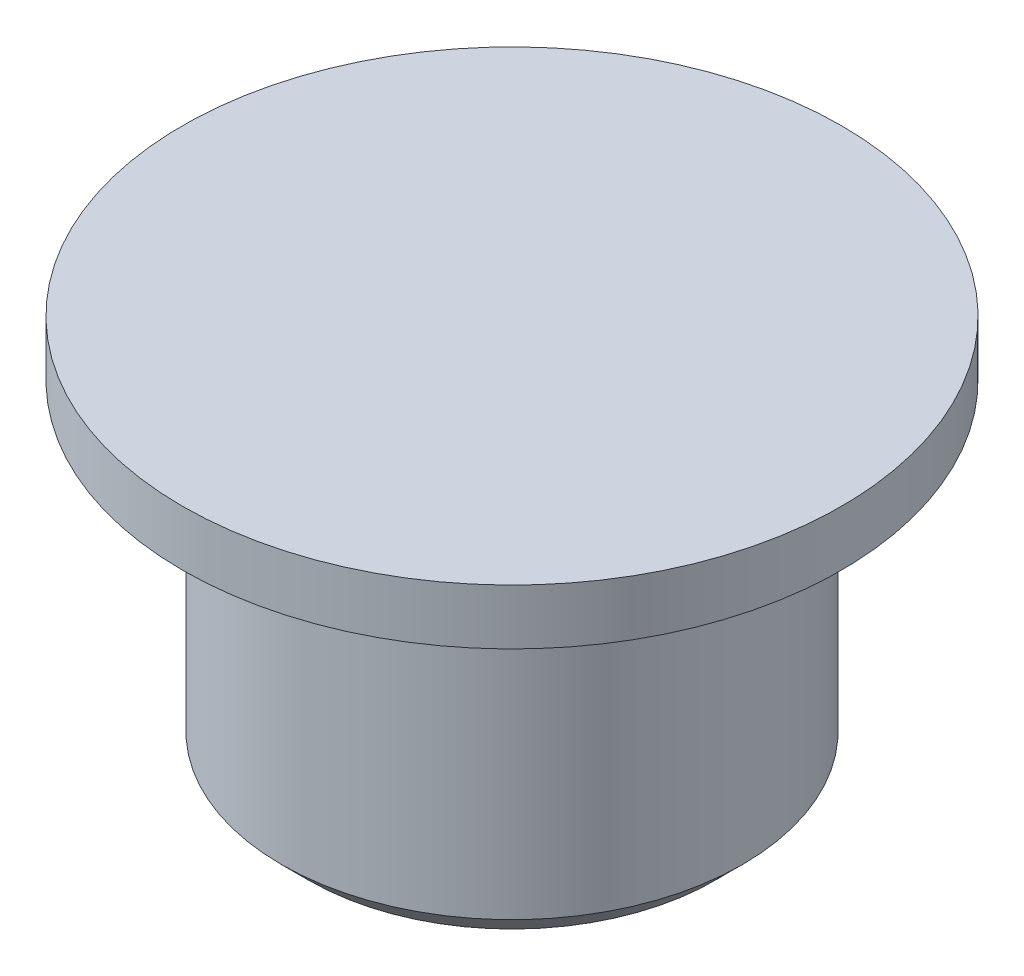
ISO-10303-21;
HEADER;
FILE_DESCRIPTION(('STEP AP214'),'2;1');
FILE_NAME('part.step','',(''),(''),'','','');
FILE_SCHEMA(('AUTOMOTIVE_DESIGN { 1 0 10303 214 1 1 1 1 }'));
ENDSEC;
DATA;
#1=APPLICATION_CONTEXT('core data for automotive mechanical design processes');
#2=APPLICATION_PROTOCOL_DEFINITION('international standard','automotive_design',2000,#1);
#3=PRODUCT_CONTEXT('',#1,'mechanical');
#4=PRODUCT('Part','Part','',(#3));
#5=PRODUCT_RELATED_PRODUCT_CATEGORY('part','',(#4));
#6=PRODUCT_DEFINITION_FORMATION('','',#4);
#7=PRODUCT_DEFINITION_CONTEXT('part definition',#1,'design');
#8=PRODUCT_DEFINITION('design','',#6,#7);
#9=PRODUCT_DEFINITION_SHAPE('','',#8);
#10=(LENGTH_UNIT() NAMED_UNIT(*) SI_UNIT(.MILLI.,.METRE.));
#11=(NAMED_UNIT(*) PLANE_ANGLE_UNIT() SI_UNIT($,.RADIAN.));
#12=(NAMED_UNIT(*) SI_UNIT($,.STERADIAN.) SOLID_ANGLE_UNIT());
#13=UNCERTAINTY_MEASURE_WITH_UNIT(LENGTH_MEASURE(1.E-05),#10,'distance_accuracy_value','');
#14=(GEOMETRIC_REPRESENTATION_CONTEXT(3) GLOBAL_UNCERTAINTY_ASSIGNED_CONTEXT((#13)) GLOBAL_UNIT_ASSIGNED_CONTEXT((#10,
#11,#12)) REPRESENTATION_CONTEXT('',''));
#15=CARTESIAN_POINT('',(0.,0.,0.));
#16=DIRECTION('',(0.,0.,1.));
#17=DIRECTION('',(1.,0.,0.));
#18=AXIS2_PLACEMENT_3D('',#15,#16,#17);
#19=CARTESIAN_POINT('',(0.,12.,0.));
#20=DIRECTION('',(0.,-1.,0.));
#21=DIRECTION('',(0.,0.,-1.));
#22=AXIS2_PLACEMENT_3D('',#19,#20,#21);
#23=CYLINDRICAL_SURFACE('',#22,8.33);
#24=CARTESIAN_POINT('',(0.,1.,0.));
#25=DIRECTION('',(0.,1.,0.));
#26=DIRECTION('',(0.,0.,1.));
#27=AXIS2_PLACEMENT_3D('',#24,#25,#26);
#28=CIRCLE('',#27,8.33);
#29=CARTESIAN_POINT('',(0.,1.,8.33));
#30=VERTEX_POINT('',#29);
#31=EDGE_CURVE('E38',#30,#30,#28,.T.);
#32=ORIENTED_EDGE('',*,*,#31,.T.);
#33=EDGE_LOOP('',(#32));
#34=FACE_BOUND('',#33,.T.);
#35=CARTESIAN_POINT('',(0.,12.,0.));
#36=DIRECTION('',(0.,1.,0.));
#37=DIRECTION('',(0.,0.,1.));
#38=AXIS2_PLACEMENT_3D('',#35,#36,#37);
#39=CIRCLE('',#38,8.33);
#40=CARTESIAN_POINT('',(0.,12.,8.33));
#41=VERTEX_POINT('',#40);
#42=EDGE_CURVE('E42',#41,#41,#39,.T.);
#43=ORIENTED_EDGE('',*,*,#42,.F.);
#44=EDGE_LOOP('',(#43));
#45=FACE_BOUND('',#44,.T.);
#46=ADVANCED_FACE('F31',(#34,#45),#23,.T.);
#47=CARTESIAN_POINT('',(0.,0.,0.));
#48=DIRECTION('',(0.,1.,0.));
#49=DIRECTION('',(0.,0.,1.));
#50=AXIS2_PLACEMENT_3D('',#47,#48,#49);
#51=PLANE('',#50);
#52=CARTESIAN_POINT('',(0.,0.,0.));
#53=DIRECTION('',(0.,1.,0.));
#54=DIRECTION('',(0.,0.,1.));
#55=AXIS2_PLACEMENT_3D('',#52,#53,#54);
#56=CIRCLE('',#55,7.32999999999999);
#57=CARTESIAN_POINT('',(0.,0.,7.32999999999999));
#58=VERTEX_POINT('',#57);
#59=EDGE_CURVE('E10',#58,#58,#56,.F.);
#60=ORIENTED_EDGE('',*,*,#59,.T.);
#61=EDGE_LOOP('',(#60));
#62=FACE_BOUND('',#61,.T.);
#63=ADVANCED_FACE('F66',(#62),#51,.F.);
#64=CARTESIAN_POINT('',(0.,12.,0.));
#65=DIRECTION('',(0.,1.,0.));
#66=DIRECTION('',(0.,0.,1.));
#67=AXIS2_PLACEMENT_3D('',#64,#65,#66);
#68=PLANE('',#67);
#69=CARTESIAN_POINT('',(0.,12.,0.));
#70=DIRECTION('',(0.,1.,0.));
#71=DIRECTION('',(0.,0.,1.));
#72=AXIS2_PLACEMENT_3D('',#69,#70,#71);
#73=CIRCLE('',#72,11.906890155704);
#74=CARTESIAN_POINT('',(0.,12.,11.906890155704));
#75=VERTEX_POINT('',#74);
#76=EDGE_CURVE('E49',#75,#75,#73,.T.);
#77=ORIENTED_EDGE('',*,*,#76,.F.);
#78=EDGE_LOOP('',(#77));
#79=FACE_BOUND('',#78,.T.);
#80=ORIENTED_EDGE('',*,*,#42,.T.);
#81=EDGE_LOOP('',(#80));
#82=FACE_BOUND('',#81,.T.);
#83=ADVANCED_FACE('F60',(#79,#82),#68,.F.);
#84=CARTESIAN_POINT('',(0.,14.,0.));
#85=DIRECTION('',(0.,-1.,0.));
#86=DIRECTION('',(0.,0.,-1.));
#87=AXIS2_PLACEMENT_3D('',#84,#85,#86);
#88=CYLINDRICAL_SURFACE('',#87,11.906890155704);
#89=CARTESIAN_POINT('',(0.,14.,0.));
#90=DIRECTION('',(0.,1.,0.));
#91=DIRECTION('',(0.,0.,1.));
#92=AXIS2_PLACEMENT_3D('',#89,#90,#91);
#93=CIRCLE('',#92,11.906890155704);
#94=CARTESIAN_POINT('',(0.,14.,11.906890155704));
#95=VERTEX_POINT('',#94);
#96=EDGE_CURVE('E46',#95,#95,#93,.T.);
#97=ORIENTED_EDGE('',*,*,#96,.F.);
#98=EDGE_LOOP('',(#97));
#99=FACE_BOUND('',#98,.T.);
#100=ORIENTED_EDGE('',*,*,#76,.T.);
#101=EDGE_LOOP('',(#100));
#102=FACE_BOUND('',#101,.T.);
#103=ADVANCED_FACE('F57',(#99,#102),#88,.T.);
#104=CARTESIAN_POINT('',(0.,14.,0.));
#105=DIRECTION('',(0.,1.,0.));
#106=DIRECTION('',(0.,0.,1.));
#107=AXIS2_PLACEMENT_3D('',#104,#105,#106);
#108=PLANE('',#107);
#109=ORIENTED_EDGE('',*,*,#96,.T.);
#110=EDGE_LOOP('',(#109));
#111=FACE_BOUND('',#110,.T.);
#112=ADVANCED_FACE('F55',(#111),#108,.T.);
#113=CARTESIAN_POINT('',(0.,1.,0.));
#114=DIRECTION('',(0.,1.,0.));
#115=DIRECTION('',(0.,0.,1.));
#116=AXIS2_PLACEMENT_3D('',#113,#114,#115);
#117=CONICAL_SURFACE('',#116,8.33,0.78539816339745);
#118=ORIENTED_EDGE('',*,*,#59,.F.);
#119=EDGE_LOOP('',(#118));
#120=FACE_BOUND('',#119,.T.);
#121=ORIENTED_EDGE('',*,*,#31,.F.);
#122=EDGE_LOOP('',(#121));
#123=FACE_BOUND('',#122,.T.);
#124=ADVANCED_FACE('F33',(#120,#123),#117,.T.);
#125=CLOSED_SHELL('',(#46,#63,#83,#103,#112,#124));
#126=MANIFOLD_SOLID_BREP('B2',#125);
#127=ADVANCED_BREP_SHAPE_REPRESENTATION('',(#18,#126),#14);
#128=SHAPE_DEFINITION_REPRESENTATION(#9,#127);
ENDSEC;
END-ISO-10303-21;
